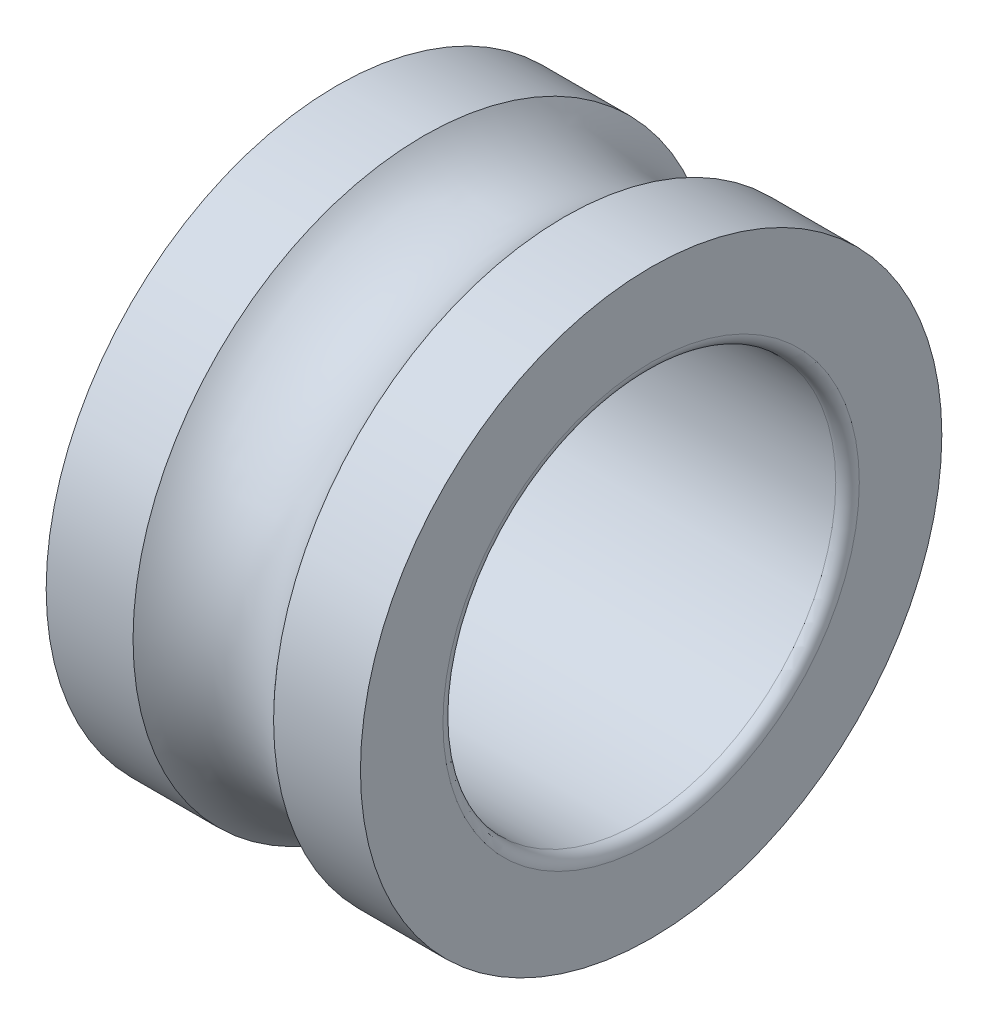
ISO-10303-21;
HEADER;
FILE_DESCRIPTION(('STEP AP214'),'2;1');
FILE_NAME('part.step','',(''),(''),'','','');
FILE_SCHEMA(('AUTOMOTIVE_DESIGN { 1 0 10303 214 1 1 1 1 }'));
ENDSEC;
DATA;
#1=APPLICATION_CONTEXT('core data for automotive mechanical design processes');
#2=APPLICATION_PROTOCOL_DEFINITION('international standard','automotive_design',2000,#1);
#3=PRODUCT_CONTEXT('',#1,'mechanical');
#4=PRODUCT('Part','Part','',(#3));
#5=PRODUCT_RELATED_PRODUCT_CATEGORY('part','',(#4));
#6=PRODUCT_DEFINITION_FORMATION('','',#4);
#7=PRODUCT_DEFINITION_CONTEXT('part definition',#1,'design');
#8=PRODUCT_DEFINITION('design','',#6,#7);
#9=PRODUCT_DEFINITION_SHAPE('','',#8);
#10=(LENGTH_UNIT() NAMED_UNIT(*) SI_UNIT(.MILLI.,.METRE.));
#11=(NAMED_UNIT(*) PLANE_ANGLE_UNIT() SI_UNIT($,.RADIAN.));
#12=(NAMED_UNIT(*) SI_UNIT($,.STERADIAN.) SOLID_ANGLE_UNIT());
#13=UNCERTAINTY_MEASURE_WITH_UNIT(LENGTH_MEASURE(1.E-05),#10,'distance_accuracy_value','');
#14=(GEOMETRIC_REPRESENTATION_CONTEXT(3) GLOBAL_UNCERTAINTY_ASSIGNED_CONTEXT((#13)) GLOBAL_UNIT_ASSIGNED_CONTEXT((#10,
#11,#12)) REPRESENTATION_CONTEXT('',''));
#15=CARTESIAN_POINT('',(0.,0.,0.));
#16=DIRECTION('',(0.,0.,1.));
#17=DIRECTION('',(1.,0.,0.));
#18=AXIS2_PLACEMENT_3D('',#15,#16,#17);
#19=CARTESIAN_POINT('',(0.300000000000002,0.,0.));
#20=DIRECTION('',(-1.,0.,0.));
#21=DIRECTION('',(0.,0.,1.));
#22=AXIS2_PLACEMENT_3D('',#19,#20,#21);
#23=TOROIDAL_SURFACE('',#22,5.3,0.300000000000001);
#24=CARTESIAN_POINT('',(0.300000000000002,0.,0.));
#25=DIRECTION('',(-1.,0.,0.));
#26=DIRECTION('',(0.,0.,1.));
#27=AXIS2_PLACEMENT_3D('',#24,#25,#26);
#28=CIRCLE('',#27,5.);
#29=CARTESIAN_POINT('',(0.300000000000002,0.,5.));
#30=VERTEX_POINT('',#29);
#31=EDGE_CURVE('E10',#30,#30,#28,.T.);
#32=ORIENTED_EDGE('',*,*,#31,.F.);
#33=EDGE_LOOP('',(#32));
#34=FACE_BOUND('',#33,.T.);
#35=CARTESIAN_POINT('',(0.,0.,0.));
#36=DIRECTION('',(-1.,0.,0.));
#37=DIRECTION('',(0.,0.,1.));
#38=AXIS2_PLACEMENT_3D('',#35,#36,#37);
#39=CIRCLE('',#38,5.3);
#40=CARTESIAN_POINT('',(0.,0.,5.3));
#41=VERTEX_POINT('',#40);
#42=EDGE_CURVE('E376',#41,#41,#39,.T.);
#43=ORIENTED_EDGE('',*,*,#42,.T.);
#44=EDGE_LOOP('',(#43));
#45=FACE_BOUND('',#44,.T.);
#46=ADVANCED_FACE('F348',(#34,#45),#23,.T.);
#47=CARTESIAN_POINT('',(0.,0.,0.));
#48=DIRECTION('',(-1.,0.,0.));
#49=DIRECTION('',(0.,0.,1.));
#50=AXIS2_PLACEMENT_3D('',#47,#48,#49);
#51=CYLINDRICAL_SURFACE('',#50,5.);
#52=CARTESIAN_POINT('',(7.7,0.,0.));
#53=DIRECTION('',(-1.,0.,0.));
#54=DIRECTION('',(0.,0.,1.));
#55=AXIS2_PLACEMENT_3D('',#52,#53,#54);
#56=CIRCLE('',#55,5.);
#57=CARTESIAN_POINT('',(7.7,0.,5.));
#58=VERTEX_POINT('',#57);
#59=EDGE_CURVE('E354',#58,#58,#56,.T.);
#60=ORIENTED_EDGE('',*,*,#59,.F.);
#61=EDGE_LOOP('',(#60));
#62=FACE_BOUND('',#61,.T.);
#63=ORIENTED_EDGE('',*,*,#31,.T.);
#64=EDGE_LOOP('',(#63));
#65=FACE_BOUND('',#64,.T.);
#66=ADVANCED_FACE('F413',(#62,#65),#51,.F.);
#67=CARTESIAN_POINT('',(7.7,0.,0.));
#68=DIRECTION('',(-1.,0.,0.));
#69=DIRECTION('',(0.,0.,1.));
#70=AXIS2_PLACEMENT_3D('',#67,#68,#69);
#71=TOROIDAL_SURFACE('',#70,5.3,0.300000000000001);
#72=CARTESIAN_POINT('',(8.,0.,0.));
#73=DIRECTION('',(-1.,0.,0.));
#74=DIRECTION('',(0.,0.,1.));
#75=AXIS2_PLACEMENT_3D('',#72,#73,#74);
#76=CIRCLE('',#75,5.3);
#77=CARTESIAN_POINT('',(8.,0.,5.3));
#78=VERTEX_POINT('',#77);
#79=EDGE_CURVE('E358',#78,#78,#76,.T.);
#80=ORIENTED_EDGE('',*,*,#79,.F.);
#81=EDGE_LOOP('',(#80));
#82=FACE_BOUND('',#81,.T.);
#83=ORIENTED_EDGE('',*,*,#59,.T.);
#84=EDGE_LOOP('',(#83));
#85=FACE_BOUND('',#84,.T.);
#86=ADVANCED_FACE('F408',(#82,#85),#71,.T.);
#87=CARTESIAN_POINT('',(8.,0.,-7.4));
#88=DIRECTION('',(-1.,0.,0.));
#89=DIRECTION('',(0.,0.,1.));
#90=AXIS2_PLACEMENT_3D('',#87,#88,#89);
#91=PLANE('',#90);
#92=CARTESIAN_POINT('',(8.,0.,0.));
#93=DIRECTION('',(-1.,0.,0.));
#94=DIRECTION('',(0.,0.,1.));
#95=AXIS2_PLACEMENT_3D('',#92,#93,#94);
#96=CIRCLE('',#95,7.4);
#97=CARTESIAN_POINT('',(8.,0.,7.4));
#98=VERTEX_POINT('',#97);
#99=EDGE_CURVE('E362',#98,#98,#96,.T.);
#100=ORIENTED_EDGE('',*,*,#99,.F.);
#101=EDGE_LOOP('',(#100));
#102=FACE_BOUND('',#101,.T.);
#103=ORIENTED_EDGE('',*,*,#79,.T.);
#104=EDGE_LOOP('',(#103));
#105=FACE_BOUND('',#104,.T.);
#106=ADVANCED_FACE('F402',(#102,#105),#91,.F.);
#107=CARTESIAN_POINT('',(0.,0.,0.));
#108=DIRECTION('',(-1.,0.,0.));
#109=DIRECTION('',(0.,0.,1.));
#110=AXIS2_PLACEMENT_3D('',#107,#108,#109);
#111=CYLINDRICAL_SURFACE('',#110,7.4);
#112=CARTESIAN_POINT('',(5.78885438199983,0.,0.));
#113=DIRECTION('',(-1.,0.,0.));
#114=DIRECTION('',(0.,0.,1.));
#115=AXIS2_PLACEMENT_3D('',#112,#113,#114);
#116=CIRCLE('',#115,7.4);
#117=CARTESIAN_POINT('',(5.78885438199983,0.,7.4));
#118=VERTEX_POINT('',#117);
#119=EDGE_CURVE('E367',#118,#118,#116,.T.);
#120=ORIENTED_EDGE('',*,*,#119,.F.);
#121=EDGE_LOOP('',(#120));
#122=FACE_BOUND('',#121,.T.);
#123=ORIENTED_EDGE('',*,*,#99,.T.);
#124=EDGE_LOOP('',(#123));
#125=FACE_BOUND('',#124,.T.);
#126=ADVANCED_FACE('F396',(#122,#125),#111,.T.);
#127=CARTESIAN_POINT('',(4.,0.,0.));
#128=DIRECTION('',(-1.,0.,0.));
#129=DIRECTION('',(0.,0.,1.));
#130=AXIS2_PLACEMENT_3D('',#127,#128,#129);
#131=TOROIDAL_SURFACE('',#130,9.,2.4);
#132=CARTESIAN_POINT('',(2.21114561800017,0.,0.));
#133=DIRECTION('',(-1.,0.,0.));
#134=DIRECTION('',(0.,0.,1.));
#135=AXIS2_PLACEMENT_3D('',#132,#133,#134);
#136=CIRCLE('',#135,7.4);
#137=CARTESIAN_POINT('',(2.21114561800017,0.,7.4));
#138=VERTEX_POINT('',#137);
#139=EDGE_CURVE('E370',#138,#138,#136,.T.);
#140=ORIENTED_EDGE('',*,*,#139,.F.);
#141=EDGE_LOOP('',(#140));
#142=FACE_BOUND('',#141,.T.);
#143=ORIENTED_EDGE('',*,*,#119,.T.);
#144=EDGE_LOOP('',(#143));
#145=FACE_BOUND('',#144,.T.);
#146=ADVANCED_FACE('F390',(#142,#145),#131,.F.);
#147=CARTESIAN_POINT('',(0.,0.,0.));
#148=DIRECTION('',(-1.,0.,0.));
#149=DIRECTION('',(0.,0.,1.));
#150=AXIS2_PLACEMENT_3D('',#147,#148,#149);
#151=CYLINDRICAL_SURFACE('',#150,7.4);
#152=CARTESIAN_POINT('',(0.,0.,0.));
#153=DIRECTION('',(-1.,0.,0.));
#154=DIRECTION('',(0.,0.,1.));
#155=AXIS2_PLACEMENT_3D('',#152,#153,#154);
#156=CIRCLE('',#155,7.4);
#157=CARTESIAN_POINT('',(0.,0.,7.4));
#158=VERTEX_POINT('',#157);
#159=EDGE_CURVE('E373',#158,#158,#156,.T.);
#160=ORIENTED_EDGE('',*,*,#159,.F.);
#161=EDGE_LOOP('',(#160));
#162=FACE_BOUND('',#161,.T.);
#163=ORIENTED_EDGE('',*,*,#139,.T.);
#164=EDGE_LOOP('',(#163));
#165=FACE_BOUND('',#164,.T.);
#166=ADVANCED_FACE('F384',(#162,#165),#151,.T.);
#167=CARTESIAN_POINT('',(0.,0.,-7.4));
#168=DIRECTION('',(1.,0.,0.));
#169=DIRECTION('',(0.,0.,-1.));
#170=AXIS2_PLACEMENT_3D('',#167,#168,#169);
#171=PLANE('',#170);
#172=ORIENTED_EDGE('',*,*,#42,.F.);
#173=EDGE_LOOP('',(#172));
#174=FACE_BOUND('',#173,.T.);
#175=ORIENTED_EDGE('',*,*,#159,.T.);
#176=EDGE_LOOP('',(#175));
#177=FACE_BOUND('',#176,.T.);
#178=ADVANCED_FACE('F381',(#174,#177),#171,.F.);
#179=CLOSED_SHELL('',(#46,#66,#86,#106,#126,#146,#166,#178));
#180=MANIFOLD_SOLID_BREP('B2',#179);
#181=ADVANCED_BREP_SHAPE_REPRESENTATION('',(#18,#180),#14);
#182=SHAPE_DEFINITION_REPRESENTATION(#9,#181);
ENDSEC;
END-ISO-10303-21;
